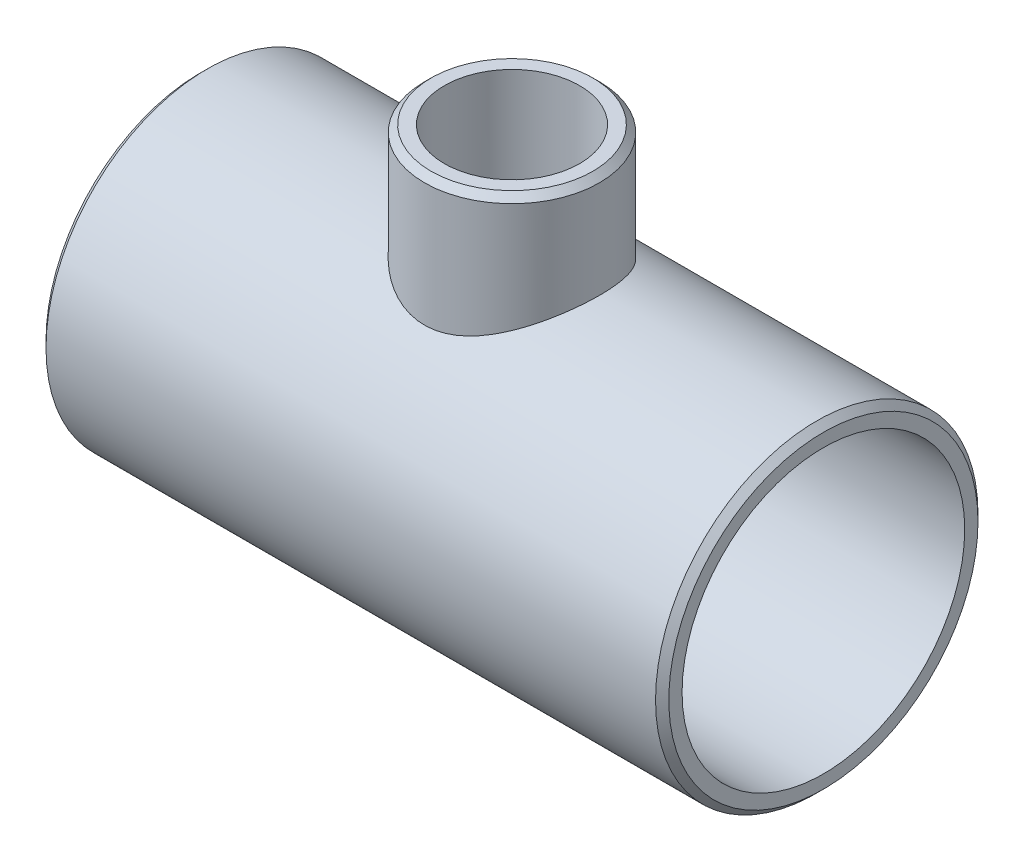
from build123d import *

# Parameters (mm, degrees)
RUNROUTE_R          = 44.45
RUNEXTRUDE_DEPTH    = 85.852
OUTLETROUTE_R       = 24.13
OUTLETEXTRUDE_DEPTH = 73.152
TEESHELL_T          = -5.4864
TEECHAMFER_SIZE     = 1.8288


with BuildPart() as part:
    # RunRoute → RunExtrude (new body)
    with BuildSketch(Plane(origin=(0, 0, 0), x_dir=(0, 0, -1), z_dir=(1, 0, 0))):
        Circle(RUNROUTE_R)
    runextrude = extrude(amount=RUNEXTRUDE_DEPTH)

    # RunExtrudeMirror: RunExtrude across plane
    add(runextrude.mirror(Plane(origin=(0, 0, 0), x_dir=(0, 0, 1), z_dir=(1, 0, 0))))

    # OutletRoute → OutletExtrude (add)
    with BuildSketch(Plane(origin=(0, 0, 0), x_dir=(1, 0, 0), z_dir=(0, 1, 0))):
        with Locations(Location((0, 0, 0), (0, 0, 90))):
            Circle(OUTLETROUTE_R)
    extrude(amount=OUTLETEXTRUDE_DEPTH)

    # TeeShell
    teeshell_openings = [part.faces().sort_by_distance(p)[0] for p in [
        (85.852, 0, 0),
        (-85.852, 0, 0),
        (0, 73.152, 0),
    ]]
    offset(amount=TEESHELL_T, openings=teeshell_openings, kind=Kind.INTERSECTION)

    # TeeChamfer
    teechamfer_edges = [part.edges().sort_by_distance(p)[0] for p in [
        (85.852, 0, 44.45),
        (-85.852, 0, 44.45),
        (0, 73.152, 24.13),
    ]]
    chamfer(teechamfer_edges, length=TEECHAMFER_SIZE)


solid = part.part
